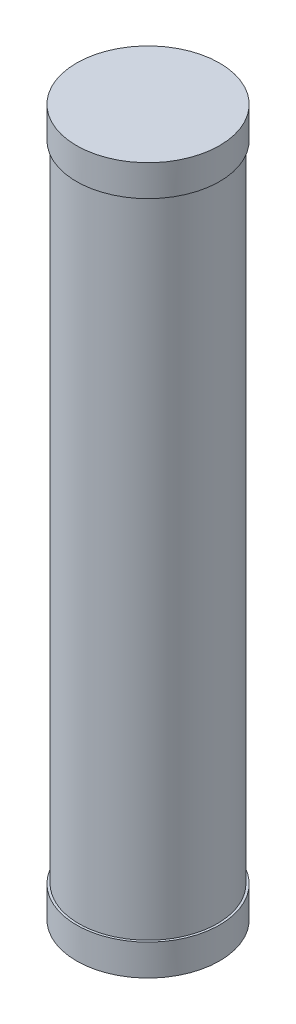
ISO-10303-21;
HEADER;
FILE_DESCRIPTION(('STEP AP214'),'2;1');
FILE_NAME('part.step','',(''),(''),'','','');
FILE_SCHEMA(('AUTOMOTIVE_DESIGN { 1 0 10303 214 1 1 1 1 }'));
ENDSEC;
DATA;
#1=APPLICATION_CONTEXT('core data for automotive mechanical design processes');
#2=APPLICATION_PROTOCOL_DEFINITION('international standard','automotive_design',2000,#1);
#3=PRODUCT_CONTEXT('',#1,'mechanical');
#4=PRODUCT('Part','Part','',(#3));
#5=PRODUCT_RELATED_PRODUCT_CATEGORY('part','',(#4));
#6=PRODUCT_DEFINITION_FORMATION('','',#4);
#7=PRODUCT_DEFINITION_CONTEXT('part definition',#1,'design');
#8=PRODUCT_DEFINITION('design','',#6,#7);
#9=PRODUCT_DEFINITION_SHAPE('','',#8);
#10=(LENGTH_UNIT() NAMED_UNIT(*) SI_UNIT(.MILLI.,.METRE.));
#11=(NAMED_UNIT(*) PLANE_ANGLE_UNIT() SI_UNIT($,.RADIAN.));
#12=(NAMED_UNIT(*) SI_UNIT($,.STERADIAN.) SOLID_ANGLE_UNIT());
#13=UNCERTAINTY_MEASURE_WITH_UNIT(LENGTH_MEASURE(1.E-05),#10,'distance_accuracy_value','');
#14=(GEOMETRIC_REPRESENTATION_CONTEXT(3) GLOBAL_UNCERTAINTY_ASSIGNED_CONTEXT((#13)) GLOBAL_UNIT_ASSIGNED_CONTEXT((#10,
#11,#12)) REPRESENTATION_CONTEXT('',''));
#15=CARTESIAN_POINT('',(0.,0.,0.));
#16=DIRECTION('',(0.,0.,1.));
#17=DIRECTION('',(1.,0.,0.));
#18=AXIS2_PLACEMENT_3D('',#15,#16,#17);
#19=CARTESIAN_POINT('',(0.,-153.,0.));
#20=DIRECTION('',(0.,1.,0.));
#21=DIRECTION('',(0.,0.,-1.));
#22=AXIS2_PLACEMENT_3D('',#19,#20,#21);
#23=CYLINDRICAL_SURFACE('',#22,31.);
#24=CARTESIAN_POINT('',(0.,-153.,0.));
#25=DIRECTION('',(0.,1.,0.));
#26=DIRECTION('',(0.,0.,1.));
#27=AXIS2_PLACEMENT_3D('',#24,#25,#26);
#28=CIRCLE('',#27,31.);
#29=CARTESIAN_POINT('',(0.,-153.,31.));
#30=VERTEX_POINT('',#29);
#31=EDGE_CURVE('E11',#30,#30,#28,.T.);
#32=ORIENTED_EDGE('',*,*,#31,.T.);
#33=EDGE_LOOP('',(#32));
#34=FACE_BOUND('',#33,.T.);
#35=CARTESIAN_POINT('',(0.,-139.5,0.));
#36=DIRECTION('',(0.,-1.,0.));
#37=DIRECTION('',(0.,0.,-1.));
#38=AXIS2_PLACEMENT_3D('',#35,#36,#37);
#39=CIRCLE('',#38,31.);
#40=CARTESIAN_POINT('',(0.,-139.5,-31.));
#41=VERTEX_POINT('',#40);
#42=EDGE_CURVE('E46',#41,#41,#39,.T.);
#43=ORIENTED_EDGE('',*,*,#42,.T.);
#44=EDGE_LOOP('',(#43));
#45=FACE_BOUND('',#44,.T.);
#46=ADVANCED_FACE('F40',(#34,#45),#23,.T.);
#47=CARTESIAN_POINT('',(0.,-153.,0.));
#48=DIRECTION('',(0.,-1.,0.));
#49=DIRECTION('',(0.,0.,1.));
#50=AXIS2_PLACEMENT_3D('',#47,#48,#49);
#51=PLANE('',#50);
#52=ORIENTED_EDGE('',*,*,#31,.F.);
#53=EDGE_LOOP('',(#52));
#54=FACE_BOUND('',#53,.T.);
#55=ADVANCED_FACE('F72',(#54),#51,.T.);
#56=CARTESIAN_POINT('',(0.,-139.5,0.));
#57=DIRECTION('',(0.,1.,0.));
#58=DIRECTION('',(0.,0.,-1.));
#59=AXIS2_PLACEMENT_3D('',#56,#57,#58);
#60=PLANE('',#59);
#61=ORIENTED_EDGE('',*,*,#42,.F.);
#62=EDGE_LOOP('',(#61));
#63=FACE_BOUND('',#62,.T.);
#64=CARTESIAN_POINT('',(0.,-139.5,0.));
#65=DIRECTION('',(0.,-1.,0.));
#66=DIRECTION('',(0.,0.,-1.));
#67=AXIS2_PLACEMENT_3D('',#64,#65,#66);
#68=CIRCLE('',#67,30.);
#69=CARTESIAN_POINT('',(0.,-139.5,-30.));
#70=VERTEX_POINT('',#69);
#71=EDGE_CURVE('E50',#70,#70,#68,.T.);
#72=ORIENTED_EDGE('',*,*,#71,.T.);
#73=EDGE_LOOP('',(#72));
#74=FACE_BOUND('',#73,.T.);
#75=ADVANCED_FACE('F67',(#63,#74),#60,.T.);
#76=CARTESIAN_POINT('',(0.,-139.5,0.));
#77=DIRECTION('',(0.,-1.,0.));
#78=DIRECTION('',(0.,0.,1.));
#79=AXIS2_PLACEMENT_3D('',#76,#77,#78);
#80=CYLINDRICAL_SURFACE('',#79,30.);
#81=ORIENTED_EDGE('',*,*,#71,.F.);
#82=EDGE_LOOP('',(#81));
#83=FACE_BOUND('',#82,.T.);
#84=CARTESIAN_POINT('',(0.,-151.5,0.));
#85=DIRECTION('',(0.,-1.,0.));
#86=DIRECTION('',(0.,0.,-1.));
#87=AXIS2_PLACEMENT_3D('',#84,#85,#86);
#88=CIRCLE('',#87,30.);
#89=CARTESIAN_POINT('',(0.,-151.5,-30.));
#90=VERTEX_POINT('',#89);
#91=EDGE_CURVE('E54',#90,#90,#88,.T.);
#92=ORIENTED_EDGE('',*,*,#91,.T.);
#93=EDGE_LOOP('',(#92));
#94=FACE_BOUND('',#93,.T.);
#95=ADVANCED_FACE('F60',(#83,#94),#80,.F.);
#96=CARTESIAN_POINT('',(0.,-151.5,0.));
#97=DIRECTION('',(0.,-1.,0.));
#98=DIRECTION('',(0.,0.,1.));
#99=AXIS2_PLACEMENT_3D('',#96,#97,#98);
#100=PLANE('',#99);
#101=ORIENTED_EDGE('',*,*,#91,.F.);
#102=EDGE_LOOP('',(#101));
#103=FACE_BOUND('',#102,.T.);
#104=ADVANCED_FACE('F62',(#103),#100,.F.);
#105=CLOSED_SHELL('',(#46,#55,#75,#95,#104));
#106=MANIFOLD_SOLID_BREP('B2',#105);
#107=CARTESIAN_POINT('',(0.,153.,0.));
#108=DIRECTION('',(0.,-1.,0.));
#109=DIRECTION('',(0.,0.,-1.));
#110=AXIS2_PLACEMENT_3D('',#107,#108,#109);
#111=CYLINDRICAL_SURFACE('',#110,31.);
#112=CARTESIAN_POINT('',(0.,153.,0.));
#113=DIRECTION('',(0.,1.,0.));
#114=DIRECTION('',(0.,0.,1.));
#115=AXIS2_PLACEMENT_3D('',#112,#113,#114);
#116=CIRCLE('',#115,31.);
#117=CARTESIAN_POINT('',(0.,153.,31.));
#118=VERTEX_POINT('',#117);
#119=EDGE_CURVE('E39',#118,#118,#116,.T.);
#120=ORIENTED_EDGE('',*,*,#119,.F.);
#121=EDGE_LOOP('',(#120));
#122=FACE_BOUND('',#121,.T.);
#123=CARTESIAN_POINT('',(0.,139.5,0.));
#124=DIRECTION('',(0.,-1.,0.));
#125=DIRECTION('',(0.,0.,-1.));
#126=AXIS2_PLACEMENT_3D('',#123,#124,#125);
#127=CIRCLE('',#126,31.);
#128=CARTESIAN_POINT('',(0.,139.5,-31.));
#129=VERTEX_POINT('',#128);
#130=EDGE_CURVE('E127',#129,#129,#127,.T.);
#131=ORIENTED_EDGE('',*,*,#130,.F.);
#132=EDGE_LOOP('',(#131));
#133=FACE_BOUND('',#132,.T.);
#134=ADVANCED_FACE('F121',(#122,#133),#111,.T.);
#135=CARTESIAN_POINT('',(0.,153.,0.));
#136=DIRECTION('',(0.,1.,0.));
#137=DIRECTION('',(0.,0.,1.));
#138=AXIS2_PLACEMENT_3D('',#135,#136,#137);
#139=PLANE('',#138);
#140=ORIENTED_EDGE('',*,*,#119,.T.);
#141=EDGE_LOOP('',(#140));
#142=FACE_BOUND('',#141,.T.);
#143=ADVANCED_FACE('F152',(#142),#139,.T.);
#144=CARTESIAN_POINT('',(0.,139.5,0.));
#145=DIRECTION('',(0.,-1.,0.));
#146=DIRECTION('',(0.,0.,-1.));
#147=AXIS2_PLACEMENT_3D('',#144,#145,#146);
#148=PLANE('',#147);
#149=ORIENTED_EDGE('',*,*,#130,.T.);
#150=EDGE_LOOP('',(#149));
#151=FACE_BOUND('',#150,.T.);
#152=CARTESIAN_POINT('',(0.,139.5,0.));
#153=DIRECTION('',(0.,-1.,0.));
#154=DIRECTION('',(0.,0.,-1.));
#155=AXIS2_PLACEMENT_3D('',#152,#153,#154);
#156=CIRCLE('',#155,30.);
#157=CARTESIAN_POINT('',(0.,139.5,-30.));
#158=VERTEX_POINT('',#157);
#159=EDGE_CURVE('E131',#158,#158,#156,.T.);
#160=ORIENTED_EDGE('',*,*,#159,.F.);
#161=EDGE_LOOP('',(#160));
#162=FACE_BOUND('',#161,.T.);
#163=ADVANCED_FACE('F145',(#151,#162),#148,.T.);
#164=CARTESIAN_POINT('',(0.,139.5,0.));
#165=DIRECTION('',(0.,1.,0.));
#166=DIRECTION('',(0.,0.,1.));
#167=AXIS2_PLACEMENT_3D('',#164,#165,#166);
#168=CYLINDRICAL_SURFACE('',#167,30.);
#169=ORIENTED_EDGE('',*,*,#159,.T.);
#170=EDGE_LOOP('',(#169));
#171=FACE_BOUND('',#170,.T.);
#172=CARTESIAN_POINT('',(0.,151.5,0.));
#173=DIRECTION('',(0.,-1.,0.));
#174=DIRECTION('',(0.,0.,-1.));
#175=AXIS2_PLACEMENT_3D('',#172,#173,#174);
#176=CIRCLE('',#175,30.);
#177=CARTESIAN_POINT('',(0.,151.5,-30.));
#178=VERTEX_POINT('',#177);
#179=EDGE_CURVE('E135',#178,#178,#176,.T.);
#180=ORIENTED_EDGE('',*,*,#179,.F.);
#181=EDGE_LOOP('',(#180));
#182=FACE_BOUND('',#181,.T.);
#183=ADVANCED_FACE('F143',(#171,#182),#168,.F.);
#184=CARTESIAN_POINT('',(0.,151.5,0.));
#185=DIRECTION('',(0.,1.,0.));
#186=DIRECTION('',(0.,0.,1.));
#187=AXIS2_PLACEMENT_3D('',#184,#185,#186);
#188=PLANE('',#187);
#189=ORIENTED_EDGE('',*,*,#179,.T.);
#190=EDGE_LOOP('',(#189));
#191=FACE_BOUND('',#190,.T.);
#192=ADVANCED_FACE('F141',(#191),#188,.F.);
#193=CLOSED_SHELL('',(#134,#143,#163,#183,#192));
#194=MANIFOLD_SOLID_BREP('B6',#193);
#195=CARTESIAN_POINT('',(0.,151.5,0.));
#196=DIRECTION('',(0.,-1.,0.));
#197=DIRECTION('',(0.,0.,-1.));
#198=AXIS2_PLACEMENT_3D('',#195,#196,#197);
#199=CYLINDRICAL_SURFACE('',#198,30.);
#200=CARTESIAN_POINT('',(0.,151.5,0.));
#201=DIRECTION('',(0.,1.,0.));
#202=DIRECTION('',(0.,0.,1.));
#203=AXIS2_PLACEMENT_3D('',#200,#201,#202);
#204=CIRCLE('',#203,30.);
#205=CARTESIAN_POINT('',(0.,151.5,30.));
#206=VERTEX_POINT('',#205);
#207=EDGE_CURVE('E120',#206,#206,#204,.T.);
#208=ORIENTED_EDGE('',*,*,#207,.F.);
#209=EDGE_LOOP('',(#208));
#210=FACE_BOUND('',#209,.T.);
#211=CARTESIAN_POINT('',(0.,-151.5,0.));
#212=DIRECTION('',(0.,1.,0.));
#213=DIRECTION('',(0.,0.,1.));
#214=AXIS2_PLACEMENT_3D('',#211,#212,#213);
#215=CIRCLE('',#214,30.);
#216=CARTESIAN_POINT('',(0.,-151.5,30.));
#217=VERTEX_POINT('',#216);
#218=EDGE_CURVE('E198',#217,#217,#215,.T.);
#219=ORIENTED_EDGE('',*,*,#218,.T.);
#220=EDGE_LOOP('',(#219));
#221=FACE_BOUND('',#220,.T.);
#222=ADVANCED_FACE('F195',(#210,#221),#199,.T.);
#223=CARTESIAN_POINT('',(0.,151.5,0.));
#224=DIRECTION('',(0.,1.,0.));
#225=DIRECTION('',(0.,0.,1.));
#226=AXIS2_PLACEMENT_3D('',#223,#224,#225);
#227=PLANE('',#226);
#228=ORIENTED_EDGE('',*,*,#207,.T.);
#229=EDGE_LOOP('',(#228));
#230=FACE_BOUND('',#229,.T.);
#231=ADVANCED_FACE('F210',(#230),#227,.T.);
#232=CARTESIAN_POINT('',(0.,-151.5,0.));
#233=DIRECTION('',(0.,1.,0.));
#234=DIRECTION('',(0.,0.,1.));
#235=AXIS2_PLACEMENT_3D('',#232,#233,#234);
#236=PLANE('',#235);
#237=ORIENTED_EDGE('',*,*,#218,.F.);
#238=EDGE_LOOP('',(#237));
#239=FACE_BOUND('',#238,.T.);
#240=ADVANCED_FACE('F208',(#239),#236,.F.);
#241=CLOSED_SHELL('',(#222,#231,#240));
#242=MANIFOLD_SOLID_BREP('B34',#241);
#243=ADVANCED_BREP_SHAPE_REPRESENTATION('',(#18,#106,#194,#242),#14);
#244=SHAPE_DEFINITION_REPRESENTATION(#9,#243);
ENDSEC;
END-ISO-10303-21;
